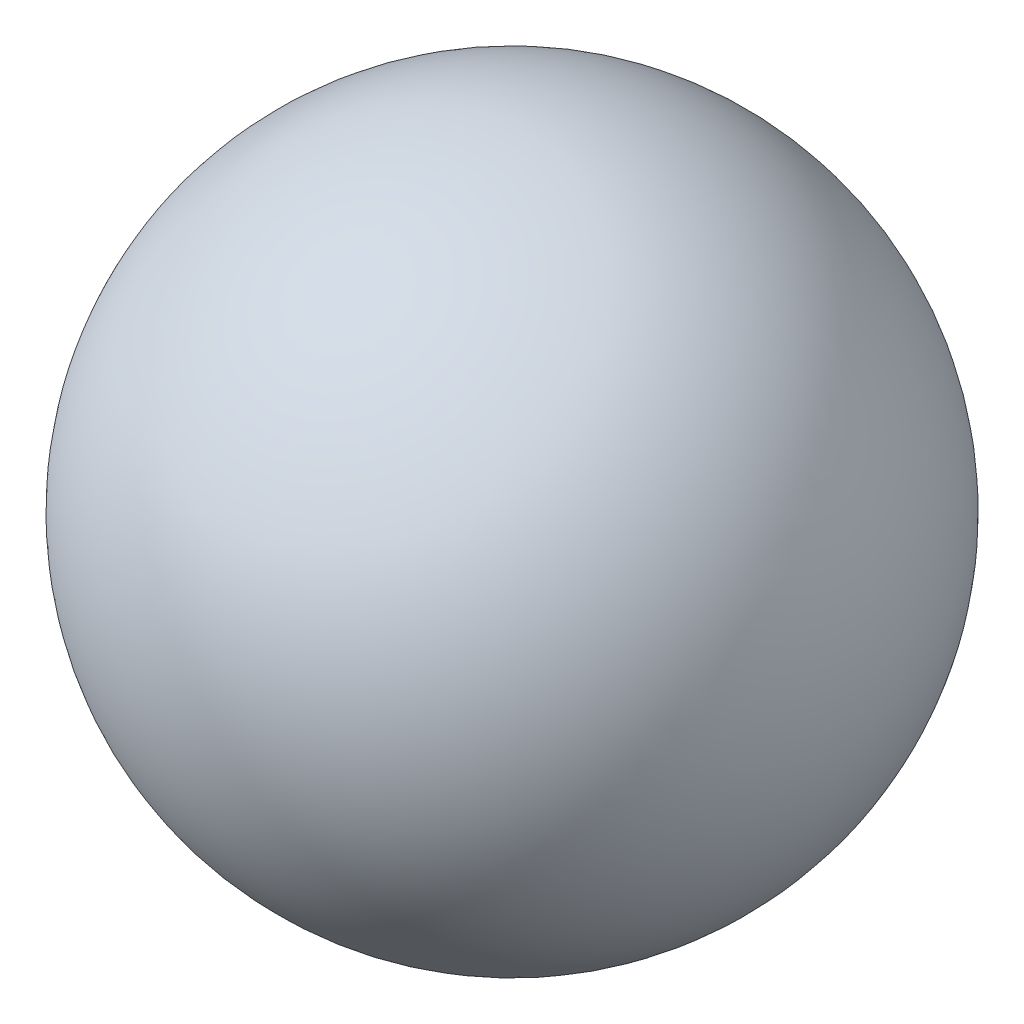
from build123d import *


with BuildPart() as part:
    # Esquisse1 → R_volution1 (revolve)
    with BuildSketch(Plane.XY):
        with BuildLine():
            Line((1.6, 10), (6.4, 10))
            ThreePointArc((6.4, 10), (4, 7.6), (1.6, 10))
        make_face()
    revolve(axis=Axis((1.6, 10, 0), (1, 0, 0)))


solid = part.part
